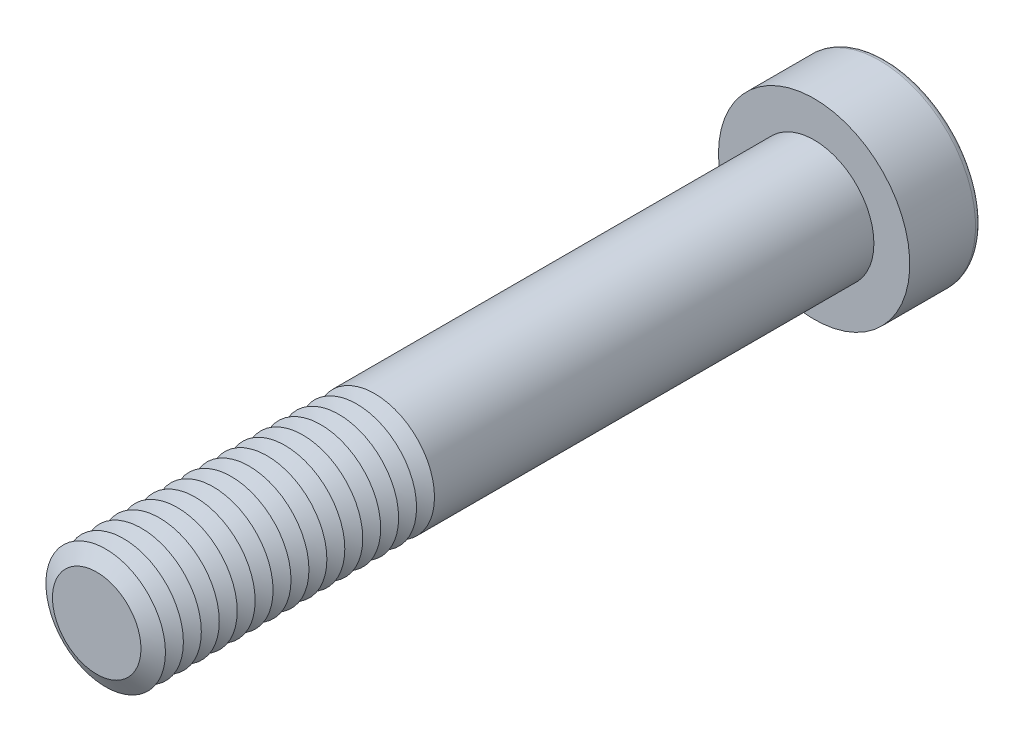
from build123d import *

# Parameters (mm, degrees)
SKETCH1_R           = 5
BOSS_EXTRUDE1_DEPTH = 60
SKETCH2_R           = 8
BOSS_EXTRUDE2_DEPTH = 6
CUT_EXTRUDE1_DEPTH  = 5.25
FILLET1_R           = 0.5
LPATTERN1_COUNT     = 16
LPATTERN1_PITCH     = 1.5


with BuildPart() as part:
    # Sketch1 → Boss-Extrude1 (new body)
    with BuildSketch(Plane.XY):
        Circle(SKETCH1_R)
    extrude(amount=BOSS_EXTRUDE1_DEPTH)

    # Sketch2 → Boss-Extrude2 (add)
    with BuildSketch(Plane(origin=(0, 0, 0), x_dir=(-1, 0, 0), z_dir=(0, 0, -1))):
        Circle(SKETCH2_R)
    extrude(amount=BOSS_EXTRUDE2_DEPTH)

    # Sketch3 → Cut-Extrude1 (cut)
    with BuildSketch(Plane(origin=(0, 0, -6), x_dir=(-1, 0, 0), z_dir=(0, 0, -1))):
        Polygon((-2.020725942, 3.5), (-4.041451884, 0), (-2.020725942, -3.5), (2.020725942, -3.5), (4.041451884, 0), (2.020725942, 3.5), align=None)
    extrude(amount=-CUT_EXTRUDE1_DEPTH, mode=Mode.SUBTRACT)

    # Fillet1
    fillet1_edges = [part.edges().sort_by_distance(p)[0] for p in [
        (8, 0, -6),
    ]]
    fillet(fillet1_edges, radius=FILLET1_R)

    # Cut-Extrude2 cone 1 section (on through the dimple's axis) → Cut-Extrude2 (revolve, cut)
    with BuildSketch(Plane(origin=(0, 0, -0.75), x_dir=(0, 1, 0), z_dir=(1, 0, 0))):
        Polygon((0, 0), (3.5, 0), (0, 2.020725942), align=None)
    revolve(axis=Axis((0, 0, -0.75), (0, 0, 1)), mode=Mode.SUBTRACT)

    # Cut-Extrude3 cone 1 section (on through the dimple's axis) → Cut-Extrude3 (revolve, cut)
    with BuildSketch(Plane(origin=(0, 0, -6), x_dir=(0, 1, 0), z_dir=(1, 0, 0))):
        Polygon((0, 0), (4.041451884, 0), (0, 1.082903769), align=None)
    revolve(axis=Axis((0, 0, -6), (0, 0, 1)), mode=Mode.SUBTRACT)

    # Sketch7 → Cut-Revolve1 (revolve, cut)
    with BuildSketch(Plane(origin=(0, 0, 0), x_dir=(0, 0, -1), z_dir=(1, 0, 0)), mode=Mode.PRIVATE) as cut_revolve1_sk:
        Polygon((-60, 3.700961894), (-59.25, 5), (-60.75, 5), align=None)
    cut_revolve1 = revolve(cut_revolve1_sk.sketch.rotate(Axis((0, 0, 60), (0, 0, -1)), 90), axis=Axis((0, 0, 60), (0, 0, -1)), mode=Mode.SUBTRACT)

    # LPattern1: Cut-Revolve1 ×16
    with Locations(*[(0, 0, -i * LPATTERN1_PITCH) for i in range(1, LPATTERN1_COUNT)]):
        add(cut_revolve1, mode=Mode.SUBTRACT)


solid = part.part
